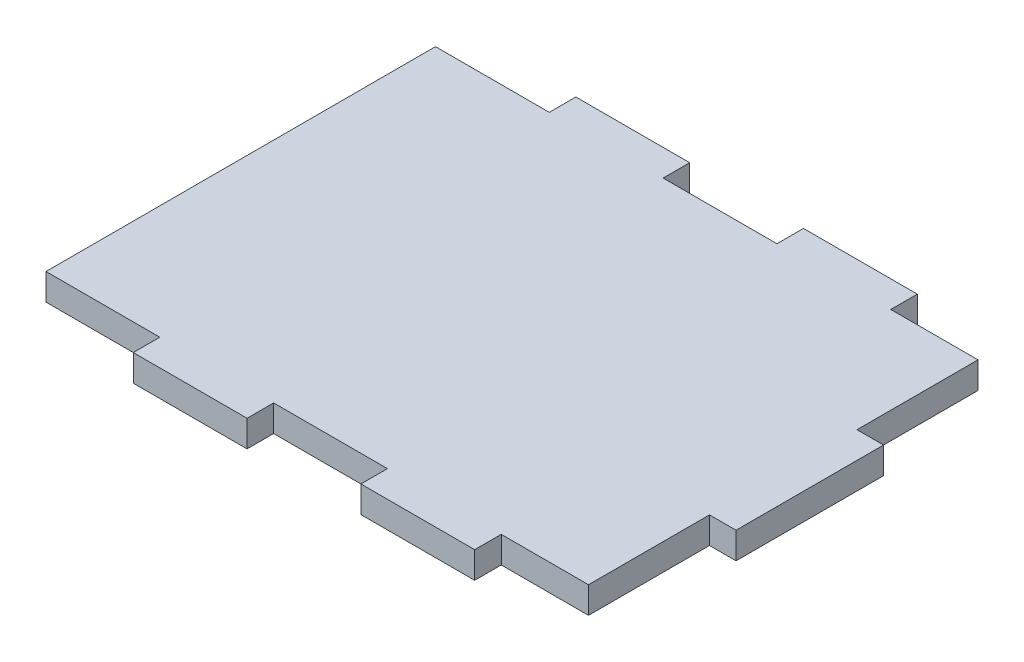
ISO-10303-21;
HEADER;
FILE_DESCRIPTION(('STEP AP214'),'2;1');
FILE_NAME('part.step','',(''),(''),'','','');
FILE_SCHEMA(('AUTOMOTIVE_DESIGN { 1 0 10303 214 1 1 1 1 }'));
ENDSEC;
DATA;
#1=APPLICATION_CONTEXT('core data for automotive mechanical design processes');
#2=APPLICATION_PROTOCOL_DEFINITION('international standard','automotive_design',2000,#1);
#3=PRODUCT_CONTEXT('',#1,'mechanical');
#4=PRODUCT('Part','Part','',(#3));
#5=PRODUCT_RELATED_PRODUCT_CATEGORY('part','',(#4));
#6=PRODUCT_DEFINITION_FORMATION('','',#4);
#7=PRODUCT_DEFINITION_CONTEXT('part definition',#1,'design');
#8=PRODUCT_DEFINITION('design','',#6,#7);
#9=PRODUCT_DEFINITION_SHAPE('','',#8);
#10=(LENGTH_UNIT() NAMED_UNIT(*) SI_UNIT(.MILLI.,.METRE.));
#11=(NAMED_UNIT(*) PLANE_ANGLE_UNIT() SI_UNIT($,.RADIAN.));
#12=(NAMED_UNIT(*) SI_UNIT($,.STERADIAN.) SOLID_ANGLE_UNIT());
#13=UNCERTAINTY_MEASURE_WITH_UNIT(LENGTH_MEASURE(1.E-05),#10,'distance_accuracy_value','');
#14=(GEOMETRIC_REPRESENTATION_CONTEXT(3) GLOBAL_UNCERTAINTY_ASSIGNED_CONTEXT((#13)) GLOBAL_UNIT_ASSIGNED_CONTEXT((#10,
#11,#12)) REPRESENTATION_CONTEXT('',''));
#15=CARTESIAN_POINT('',(0.,0.,0.));
#16=DIRECTION('',(0.,0.,1.));
#17=DIRECTION('',(1.,0.,0.));
#18=AXIS2_PLACEMENT_3D('',#15,#16,#17);
#19=CARTESIAN_POINT('',(57.15,5.334,44.45));
#20=DIRECTION('',(-1.,0.,0.));
#21=DIRECTION('',(0.,0.,1.));
#22=AXIS2_PLACEMENT_3D('',#19,#20,#21);
#23=PLANE('',#22);
#24=DIRECTION('',(0.,-1.,0.));
#25=VECTOR('',#24,1.);
#26=CARTESIAN_POINT('',(57.15,0.,14.8166666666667));
#27=LINE('',#26,#25);
#28=CARTESIAN_POINT('',(57.15,5.33400000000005,14.8166666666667));
#29=VERTEX_POINT('',#28);
#30=CARTESIAN_POINT('',(57.15,0.,14.8166666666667));
#31=VERTEX_POINT('',#30);
#32=EDGE_CURVE('E327',#29,#31,#27,.T.);
#33=ORIENTED_EDGE('',*,*,#32,.T.);
#34=DIRECTION('',(0.,0.,-1.));
#35=VECTOR('',#34,1.);
#36=CARTESIAN_POINT('',(57.15,0.,44.45));
#37=LINE('',#36,#35);
#38=CARTESIAN_POINT('',(57.15,0.,-14.8166666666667));
#39=VERTEX_POINT('',#38);
#40=EDGE_CURVE('E240',#31,#39,#37,.T.);
#41=ORIENTED_EDGE('',*,*,#40,.T.);
#42=DIRECTION('',(0.,1.,0.));
#43=VECTOR('',#42,1.);
#44=CARTESIAN_POINT('',(57.15,0.,-14.8166666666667));
#45=LINE('',#44,#43);
#46=CARTESIAN_POINT('',(57.15,5.33400000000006,-14.8166666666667));
#47=VERTEX_POINT('',#46);
#48=EDGE_CURVE('E323',#39,#47,#45,.T.);
#49=ORIENTED_EDGE('',*,*,#48,.T.);
#50=DIRECTION('',(0.,0.,-1.));
#51=VECTOR('',#50,1.);
#52=CARTESIAN_POINT('',(57.15,5.334,44.45));
#53=LINE('',#52,#51);
#54=EDGE_CURVE('E220',#29,#47,#53,.T.);
#55=ORIENTED_EDGE('',*,*,#54,.F.);
#56=EDGE_LOOP('',(#33,#41,#49,#55));
#57=FACE_BOUND('',#56,.T.);
#58=ADVANCED_FACE('F33',(#57),#23,.F.);
#59=CARTESIAN_POINT('',(-57.15,5.334,-44.45));
#60=DIRECTION('',(0.,0.,1.));
#61=DIRECTION('',(1.,0.,0.));
#62=AXIS2_PLACEMENT_3D('',#59,#60,#61);
#63=PLANE('',#62);
#64=DIRECTION('',(0.,-1.,0.));
#65=VECTOR('',#64,1.);
#66=CARTESIAN_POINT('',(-34.29,0.,-44.45));
#67=LINE('',#66,#65);
#68=CARTESIAN_POINT('',(-34.29,5.33400000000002,-44.45));
#69=VERTEX_POINT('',#68);
#70=CARTESIAN_POINT('',(-34.29,0.,-44.45));
#71=VERTEX_POINT('',#70);
#72=EDGE_CURVE('E57',#69,#71,#67,.T.);
#73=ORIENTED_EDGE('',*,*,#72,.F.);
#74=DIRECTION('',(-1.,0.,0.));
#75=VECTOR('',#74,1.);
#76=CARTESIAN_POINT('',(-57.15,5.334,-44.45));
#77=LINE('',#76,#75);
#78=CARTESIAN_POINT('',(-11.43,5.334,-44.45));
#79=VERTEX_POINT('',#78);
#80=EDGE_CURVE('E222',#79,#69,#77,.T.);
#81=ORIENTED_EDGE('',*,*,#80,.F.);
#82=DIRECTION('',(0.,1.,0.));
#83=VECTOR('',#82,1.);
#84=CARTESIAN_POINT('',(-11.43,0.,-44.45));
#85=LINE('',#84,#83);
#86=CARTESIAN_POINT('',(-11.43,0.,-44.45));
#87=VERTEX_POINT('',#86);
#88=EDGE_CURVE('E274',#87,#79,#85,.T.);
#89=ORIENTED_EDGE('',*,*,#88,.F.);
#90=DIRECTION('',(-1.,0.,0.));
#91=VECTOR('',#90,1.);
#92=CARTESIAN_POINT('',(-57.15,0.,-44.45));
#93=LINE('',#92,#91);
#94=EDGE_CURVE('E236',#87,#71,#93,.T.);
#95=ORIENTED_EDGE('',*,*,#94,.T.);
#96=EDGE_LOOP('',(#73,#81,#89,#95));
#97=FACE_BOUND('',#96,.T.);
#98=ADVANCED_FACE('F454',(#97),#63,.F.);
#99=DIRECTION('',(0.,-1.,0.));
#100=VECTOR('',#99,1.);
#101=CARTESIAN_POINT('',(11.43,0.,-44.45));
#102=LINE('',#101,#100);
#103=CARTESIAN_POINT('',(11.43,5.33400000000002,-44.45));
#104=VERTEX_POINT('',#103);
#105=CARTESIAN_POINT('',(11.43,0.,-44.45));
#106=VERTEX_POINT('',#105);
#107=EDGE_CURVE('E303',#104,#106,#102,.T.);
#108=ORIENTED_EDGE('',*,*,#107,.F.);
#109=CARTESIAN_POINT('',(34.29,5.33400000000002,-44.45));
#110=VERTEX_POINT('',#109);
#111=EDGE_CURVE('E248',#110,#104,#77,.T.);
#112=ORIENTED_EDGE('',*,*,#111,.F.);
#113=DIRECTION('',(0.,1.,0.));
#114=VECTOR('',#113,1.);
#115=CARTESIAN_POINT('',(34.29,0.,-44.45));
#116=LINE('',#115,#114);
#117=CARTESIAN_POINT('',(34.29,0.,-44.45));
#118=VERTEX_POINT('',#117);
#119=EDGE_CURVE('E293',#118,#110,#116,.T.);
#120=ORIENTED_EDGE('',*,*,#119,.F.);
#121=EDGE_CURVE('E231',#118,#106,#93,.T.);
#122=ORIENTED_EDGE('',*,*,#121,.T.);
#123=EDGE_LOOP('',(#108,#112,#120,#122));
#124=FACE_BOUND('',#123,.T.);
#125=ADVANCED_FACE('F399',(#124),#63,.F.);
#126=CARTESIAN_POINT('',(-57.15,5.334,44.45));
#127=DIRECTION('',(1.,0.,0.));
#128=DIRECTION('',(0.,0.,-1.));
#129=AXIS2_PLACEMENT_3D('',#126,#127,#128);
#130=PLANE('',#129);
#131=DIRECTION('',(0.,-1.,0.));
#132=VECTOR('',#131,1.);
#133=CARTESIAN_POINT('',(-57.15,0.,-39.116));
#134=LINE('',#133,#132);
#135=CARTESIAN_POINT('',(-57.15,5.334,-39.116));
#136=VERTEX_POINT('',#135);
#137=CARTESIAN_POINT('',(-57.15,0.,-39.116));
#138=VERTEX_POINT('',#137);
#139=EDGE_CURVE('E266',#136,#138,#134,.T.);
#140=ORIENTED_EDGE('',*,*,#139,.T.);
#141=DIRECTION('',(0.,0.,1.));
#142=VECTOR('',#141,1.);
#143=CARTESIAN_POINT('',(-57.15,0.,44.45));
#144=LINE('',#143,#142);
#145=CARTESIAN_POINT('',(-57.15,0.,39.116));
#146=VERTEX_POINT('',#145);
#147=EDGE_CURVE('E225',#138,#146,#144,.T.);
#148=ORIENTED_EDGE('',*,*,#147,.T.);
#149=DIRECTION('',(0.,1.,0.));
#150=VECTOR('',#149,1.);
#151=CARTESIAN_POINT('',(-57.15,0.,39.116));
#152=LINE('',#151,#150);
#153=CARTESIAN_POINT('',(-57.15,5.334,39.116));
#154=VERTEX_POINT('',#153);
#155=EDGE_CURVE('E339',#146,#154,#152,.T.);
#156=ORIENTED_EDGE('',*,*,#155,.T.);
#157=DIRECTION('',(0.,0.,1.));
#158=VECTOR('',#157,1.);
#159=CARTESIAN_POINT('',(-57.15,5.334,44.45));
#160=LINE('',#159,#158);
#161=EDGE_CURVE('E245',#136,#154,#160,.T.);
#162=ORIENTED_EDGE('',*,*,#161,.F.);
#163=EDGE_LOOP('',(#140,#148,#156,#162));
#164=FACE_BOUND('',#163,.T.);
#165=ADVANCED_FACE('F378',(#164),#130,.F.);
#166=CARTESIAN_POINT('',(-57.15,5.334,44.45));
#167=DIRECTION('',(0.,0.,-1.));
#168=DIRECTION('',(-1.,0.,0.));
#169=AXIS2_PLACEMENT_3D('',#166,#167,#168);
#170=PLANE('',#169);
#171=DIRECTION('',(0.,-1.,0.));
#172=VECTOR('',#171,1.);
#173=CARTESIAN_POINT('',(34.29,0.,44.45));
#174=LINE('',#173,#172);
#175=CARTESIAN_POINT('',(34.29,5.33400000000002,44.45));
#176=VERTEX_POINT('',#175);
#177=CARTESIAN_POINT('',(34.29,0.,44.45));
#178=VERTEX_POINT('',#177);
#179=EDGE_CURVE('E356',#176,#178,#174,.T.);
#180=ORIENTED_EDGE('',*,*,#179,.F.);
#181=DIRECTION('',(1.,0.,0.));
#182=VECTOR('',#181,1.);
#183=CARTESIAN_POINT('',(-57.15,5.334,44.45));
#184=LINE('',#183,#182);
#185=CARTESIAN_POINT('',(11.43,5.334,44.45));
#186=VERTEX_POINT('',#185);
#187=EDGE_CURVE('E41',#186,#176,#184,.T.);
#188=ORIENTED_EDGE('',*,*,#187,.F.);
#189=DIRECTION('',(0.,1.,0.));
#190=VECTOR('',#189,1.);
#191=CARTESIAN_POINT('',(11.43,0.,44.45));
#192=LINE('',#191,#190);
#193=CARTESIAN_POINT('',(11.43,0.,44.45));
#194=VERTEX_POINT('',#193);
#195=EDGE_CURVE('E346',#194,#186,#192,.T.);
#196=ORIENTED_EDGE('',*,*,#195,.F.);
#197=DIRECTION('',(1.,0.,0.));
#198=VECTOR('',#197,1.);
#199=CARTESIAN_POINT('',(-57.15,0.,44.45));
#200=LINE('',#199,#198);
#201=EDGE_CURVE('E36',#194,#178,#200,.T.);
#202=ORIENTED_EDGE('',*,*,#201,.T.);
#203=EDGE_LOOP('',(#180,#188,#196,#202));
#204=FACE_BOUND('',#203,.T.);
#205=ADVANCED_FACE('F437',(#204),#170,.F.);
#206=DIRECTION('',(0.,-1.,0.));
#207=VECTOR('',#206,1.);
#208=CARTESIAN_POINT('',(-11.43,0.,44.45));
#209=LINE('',#208,#207);
#210=CARTESIAN_POINT('',(-11.43,5.33400000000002,44.45));
#211=VERTEX_POINT('',#210);
#212=CARTESIAN_POINT('',(-11.43,0.,44.45));
#213=VERTEX_POINT('',#212);
#214=EDGE_CURVE('E213',#211,#213,#209,.T.);
#215=ORIENTED_EDGE('',*,*,#214,.F.);
#216=CARTESIAN_POINT('',(-34.29,5.33400000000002,44.45));
#217=VERTEX_POINT('',#216);
#218=EDGE_CURVE('E11',#217,#211,#184,.T.);
#219=ORIENTED_EDGE('',*,*,#218,.F.);
#220=DIRECTION('',(0.,1.,0.));
#221=VECTOR('',#220,1.);
#222=CARTESIAN_POINT('',(-34.29,0.,44.45));
#223=LINE('',#222,#221);
#224=CARTESIAN_POINT('',(-34.29,0.,44.45));
#225=VERTEX_POINT('',#224);
#226=EDGE_CURVE('E199',#225,#217,#223,.T.);
#227=ORIENTED_EDGE('',*,*,#226,.F.);
#228=EDGE_CURVE('E212',#225,#213,#200,.T.);
#229=ORIENTED_EDGE('',*,*,#228,.T.);
#230=EDGE_LOOP('',(#215,#219,#227,#229));
#231=FACE_BOUND('',#230,.T.);
#232=ADVANCED_FACE('F211',(#231),#170,.F.);
#233=CARTESIAN_POINT('',(57.15,5.334,-44.45));
#234=DIRECTION('',(0.,-1.,0.));
#235=DIRECTION('',(0.,0.,-1.));
#236=AXIS2_PLACEMENT_3D('',#233,#234,#235);
#237=PLANE('',#236);
#238=DIRECTION('',(0.,0.,-1.));
#239=VECTOR('',#238,1.);
#240=CARTESIAN_POINT('',(-11.43,5.33400000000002,44.45));
#241=LINE('',#240,#239);
#242=CARTESIAN_POINT('',(-11.43,5.33400000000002,39.116));
#243=VERTEX_POINT('',#242);
#244=EDGE_CURVE('E359',#211,#243,#241,.T.);
#245=ORIENTED_EDGE('',*,*,#244,.T.);
#246=DIRECTION('',(-1.,0.,0.));
#247=VECTOR('',#246,1.);
#248=CARTESIAN_POINT('',(57.15,5.334,39.116));
#249=LINE('',#248,#247);
#250=CARTESIAN_POINT('',(11.43,5.33400000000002,39.116));
#251=VERTEX_POINT('',#250);
#252=EDGE_CURVE('E260',#251,#243,#249,.T.);
#253=ORIENTED_EDGE('',*,*,#252,.F.);
#254=DIRECTION('',(0.,0.,-1.));
#255=VECTOR('',#254,1.);
#256=CARTESIAN_POINT('',(11.43,5.33400000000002,44.45));
#257=LINE('',#256,#255);
#258=EDGE_CURVE('E349',#186,#251,#257,.T.);
#259=ORIENTED_EDGE('',*,*,#258,.F.);
#260=ORIENTED_EDGE('',*,*,#187,.T.);
#261=DIRECTION('',(0.,0.,-1.));
#262=VECTOR('',#261,1.);
#263=CARTESIAN_POINT('',(34.29,5.33400000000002,44.45));
#264=LINE('',#263,#262);
#265=CARTESIAN_POINT('',(34.29,5.33400000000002,39.116));
#266=VERTEX_POINT('',#265);
#267=EDGE_CURVE('E341',#176,#266,#264,.T.);
#268=ORIENTED_EDGE('',*,*,#267,.T.);
#269=CARTESIAN_POINT('',(51.816,5.334,39.116));
#270=VERTEX_POINT('',#269);
#271=EDGE_CURVE('E257',#270,#266,#249,.T.);
#272=ORIENTED_EDGE('',*,*,#271,.F.);
#273=DIRECTION('',(0.,0.,1.));
#274=VECTOR('',#273,1.);
#275=CARTESIAN_POINT('',(51.816,5.334,-44.45));
#276=LINE('',#275,#274);
#277=CARTESIAN_POINT('',(51.816,5.33400000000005,14.8166666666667));
#278=VERTEX_POINT('',#277);
#279=EDGE_CURVE('E255',#278,#270,#276,.T.);
#280=ORIENTED_EDGE('',*,*,#279,.F.);
#281=DIRECTION('',(1.,0.,0.));
#282=VECTOR('',#281,1.);
#283=CARTESIAN_POINT('',(51.816,5.33400000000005,14.8166666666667));
#284=LINE('',#283,#282);
#285=EDGE_CURVE('E320',#278,#29,#284,.T.);
#286=ORIENTED_EDGE('',*,*,#285,.T.);
#287=ORIENTED_EDGE('',*,*,#54,.T.);
#288=DIRECTION('',(1.,0.,0.));
#289=VECTOR('',#288,1.);
#290=CARTESIAN_POINT('',(51.816,5.33400000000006,-14.8166666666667));
#291=LINE('',#290,#289);
#292=CARTESIAN_POINT('',(51.816,5.33400000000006,-14.8166666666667));
#293=VERTEX_POINT('',#292);
#294=EDGE_CURVE('E318',#293,#47,#291,.T.);
#295=ORIENTED_EDGE('',*,*,#294,.F.);
#296=CARTESIAN_POINT('',(51.816,5.334,-39.116));
#297=VERTEX_POINT('',#296);
#298=EDGE_CURVE('E254',#297,#293,#276,.T.);
#299=ORIENTED_EDGE('',*,*,#298,.F.);
#300=DIRECTION('',(1.,0.,0.));
#301=VECTOR('',#300,1.);
#302=CARTESIAN_POINT('',(57.15,5.334,-39.116));
#303=LINE('',#302,#301);
#304=CARTESIAN_POINT('',(34.29,5.33400000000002,-39.116));
#305=VERTEX_POINT('',#304);
#306=EDGE_CURVE('E251',#305,#297,#303,.T.);
#307=ORIENTED_EDGE('',*,*,#306,.F.);
#308=DIRECTION('',(0.,0.,1.));
#309=VECTOR('',#308,1.);
#310=CARTESIAN_POINT('',(34.29,5.33400000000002,-44.45));
#311=LINE('',#310,#309);
#312=EDGE_CURVE('E296',#110,#305,#311,.T.);
#313=ORIENTED_EDGE('',*,*,#312,.F.);
#314=ORIENTED_EDGE('',*,*,#111,.T.);
#315=DIRECTION('',(0.,0.,1.));
#316=VECTOR('',#315,1.);
#317=CARTESIAN_POINT('',(11.43,5.33400000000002,-44.45));
#318=LINE('',#317,#316);
#319=CARTESIAN_POINT('',(11.43,5.33400000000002,-39.116));
#320=VERTEX_POINT('',#319);
#321=EDGE_CURVE('E286',#104,#320,#318,.T.);
#322=ORIENTED_EDGE('',*,*,#321,.T.);
#323=CARTESIAN_POINT('',(-11.43,5.33400000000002,-39.116));
#324=VERTEX_POINT('',#323);
#325=EDGE_CURVE('E253',#324,#320,#303,.T.);
#326=ORIENTED_EDGE('',*,*,#325,.F.);
#327=DIRECTION('',(0.,0.,1.));
#328=VECTOR('',#327,1.);
#329=CARTESIAN_POINT('',(-11.43,5.33400000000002,-44.45));
#330=LINE('',#329,#328);
#331=EDGE_CURVE('E277',#79,#324,#330,.T.);
#332=ORIENTED_EDGE('',*,*,#331,.F.);
#333=ORIENTED_EDGE('',*,*,#80,.T.);
#334=DIRECTION('',(0.,0.,1.));
#335=VECTOR('',#334,1.);
#336=CARTESIAN_POINT('',(-34.29,5.33400000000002,-44.45));
#337=LINE('',#336,#335);
#338=CARTESIAN_POINT('',(-34.29,5.33400000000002,-39.116));
#339=VERTEX_POINT('',#338);
#340=EDGE_CURVE('E270',#69,#339,#337,.T.);
#341=ORIENTED_EDGE('',*,*,#340,.T.);
#342=EDGE_CURVE('E242',#136,#339,#303,.T.);
#343=ORIENTED_EDGE('',*,*,#342,.F.);
#344=ORIENTED_EDGE('',*,*,#161,.T.);
#345=CARTESIAN_POINT('',(-34.29,5.33400000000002,39.116));
#346=VERTEX_POINT('',#345);
#347=EDGE_CURVE('E258',#346,#154,#249,.T.);
#348=ORIENTED_EDGE('',*,*,#347,.F.);
#349=DIRECTION('',(0.,0.,-1.));
#350=VECTOR('',#349,1.);
#351=CARTESIAN_POINT('',(-34.29,5.33400000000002,44.45));
#352=LINE('',#351,#350);
#353=EDGE_CURVE('E204',#217,#346,#352,.T.);
#354=ORIENTED_EDGE('',*,*,#353,.F.);
#355=ORIENTED_EDGE('',*,*,#218,.T.);
#356=EDGE_LOOP('',(#245,#253,#259,#260,#268,#272,#280,#286,#287,#295,#299,#307,#313,#314,#322,
#326,#332,#333,#341,#343,#344,#348,#354,#355));
#357=FACE_BOUND('',#356,.T.);
#358=ADVANCED_FACE('F373',(#357),#237,.F.);
#359=CARTESIAN_POINT('',(57.15,0.,-44.45));
#360=DIRECTION('',(0.,-1.,0.));
#361=DIRECTION('',(0.,0.,-1.));
#362=AXIS2_PLACEMENT_3D('',#359,#360,#361);
#363=PLANE('',#362);
#364=ORIENTED_EDGE('',*,*,#147,.F.);
#365=DIRECTION('',(1.,0.,0.));
#366=VECTOR('',#365,1.);
#367=CARTESIAN_POINT('',(-57.15,0.,-39.116));
#368=LINE('',#367,#366);
#369=CARTESIAN_POINT('',(-34.29,0.,-39.116));
#370=VERTEX_POINT('',#369);
#371=EDGE_CURVE('E261',#138,#370,#368,.T.);
#372=ORIENTED_EDGE('',*,*,#371,.T.);
#373=DIRECTION('',(0.,0.,1.));
#374=VECTOR('',#373,1.);
#375=CARTESIAN_POINT('',(-34.29,0.,-44.45));
#376=LINE('',#375,#374);
#377=EDGE_CURVE('E271',#71,#370,#376,.T.);
#378=ORIENTED_EDGE('',*,*,#377,.F.);
#379=ORIENTED_EDGE('',*,*,#94,.F.);
#380=DIRECTION('',(0.,0.,1.));
#381=VECTOR('',#380,1.);
#382=CARTESIAN_POINT('',(-11.43,0.,-44.45));
#383=LINE('',#382,#381);
#384=CARTESIAN_POINT('',(-11.43,0.,-39.116));
#385=VERTEX_POINT('',#384);
#386=EDGE_CURVE('E273',#87,#385,#383,.T.);
#387=ORIENTED_EDGE('',*,*,#386,.T.);
#388=CARTESIAN_POINT('',(11.43,0.,-39.116));
#389=VERTEX_POINT('',#388);
#390=EDGE_CURVE('E264',#385,#389,#368,.T.);
#391=ORIENTED_EDGE('',*,*,#390,.T.);
#392=DIRECTION('',(0.,0.,1.));
#393=VECTOR('',#392,1.);
#394=CARTESIAN_POINT('',(11.43,0.,-44.45));
#395=LINE('',#394,#393);
#396=EDGE_CURVE('E289',#106,#389,#395,.T.);
#397=ORIENTED_EDGE('',*,*,#396,.F.);
#398=ORIENTED_EDGE('',*,*,#121,.F.);
#399=DIRECTION('',(0.,0.,1.));
#400=VECTOR('',#399,1.);
#401=CARTESIAN_POINT('',(34.29,0.,-44.45));
#402=LINE('',#401,#400);
#403=CARTESIAN_POINT('',(34.29,0.,-39.116));
#404=VERTEX_POINT('',#403);
#405=EDGE_CURVE('E292',#118,#404,#402,.T.);
#406=ORIENTED_EDGE('',*,*,#405,.T.);
#407=CARTESIAN_POINT('',(51.816,0.,-39.116));
#408=VERTEX_POINT('',#407);
#409=EDGE_CURVE('E265',#404,#408,#368,.T.);
#410=ORIENTED_EDGE('',*,*,#409,.T.);
#411=DIRECTION('',(0.,0.,1.));
#412=VECTOR('',#411,1.);
#413=CARTESIAN_POINT('',(51.816,0.,-44.45));
#414=LINE('',#413,#412);
#415=CARTESIAN_POINT('',(51.816,0.,-14.8166666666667));
#416=VERTEX_POINT('',#415);
#417=EDGE_CURVE('E306',#408,#416,#414,.T.);
#418=ORIENTED_EDGE('',*,*,#417,.T.);
#419=DIRECTION('',(1.,0.,0.));
#420=VECTOR('',#419,1.);
#421=CARTESIAN_POINT('',(51.816,0.,-14.8166666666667));
#422=LINE('',#421,#420);
#423=EDGE_CURVE('E314',#416,#39,#422,.T.);
#424=ORIENTED_EDGE('',*,*,#423,.T.);
#425=ORIENTED_EDGE('',*,*,#40,.F.);
#426=DIRECTION('',(1.,0.,0.));
#427=VECTOR('',#426,1.);
#428=CARTESIAN_POINT('',(51.816,0.,14.8166666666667));
#429=LINE('',#428,#427);
#430=CARTESIAN_POINT('',(51.816,0.,14.8166666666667));
#431=VERTEX_POINT('',#430);
#432=EDGE_CURVE('E312',#431,#31,#429,.T.);
#433=ORIENTED_EDGE('',*,*,#432,.F.);
#434=CARTESIAN_POINT('',(51.816,0.,39.116));
#435=VERTEX_POINT('',#434);
#436=EDGE_CURVE('E311',#431,#435,#414,.T.);
#437=ORIENTED_EDGE('',*,*,#436,.T.);
#438=DIRECTION('',(-1.,0.,0.));
#439=VECTOR('',#438,1.);
#440=CARTESIAN_POINT('',(57.15,0.,39.116));
#441=LINE('',#440,#439);
#442=CARTESIAN_POINT('',(34.29,0.,39.116));
#443=VERTEX_POINT('',#442);
#444=EDGE_CURVE('E335',#435,#443,#441,.T.);
#445=ORIENTED_EDGE('',*,*,#444,.T.);
#446=DIRECTION('',(0.,0.,-1.));
#447=VECTOR('',#446,1.);
#448=CARTESIAN_POINT('',(34.29,0.,44.45));
#449=LINE('',#448,#447);
#450=EDGE_CURVE('E342',#178,#443,#449,.T.);
#451=ORIENTED_EDGE('',*,*,#450,.F.);
#452=ORIENTED_EDGE('',*,*,#201,.F.);
#453=DIRECTION('',(0.,0.,-1.));
#454=VECTOR('',#453,1.);
#455=CARTESIAN_POINT('',(11.43,0.,44.45));
#456=LINE('',#455,#454);
#457=CARTESIAN_POINT('',(11.43,0.,39.116));
#458=VERTEX_POINT('',#457);
#459=EDGE_CURVE('E345',#194,#458,#456,.T.);
#460=ORIENTED_EDGE('',*,*,#459,.T.);
#461=CARTESIAN_POINT('',(-11.43,0.,39.116));
#462=VERTEX_POINT('',#461);
#463=EDGE_CURVE('E338',#458,#462,#441,.T.);
#464=ORIENTED_EDGE('',*,*,#463,.T.);
#465=DIRECTION('',(0.,0.,-1.));
#466=VECTOR('',#465,1.);
#467=CARTESIAN_POINT('',(-11.43,0.,44.45));
#468=LINE('',#467,#466);
#469=EDGE_CURVE('E205',#213,#462,#468,.T.);
#470=ORIENTED_EDGE('',*,*,#469,.F.);
#471=ORIENTED_EDGE('',*,*,#228,.F.);
#472=DIRECTION('',(0.,0.,-1.));
#473=VECTOR('',#472,1.);
#474=CARTESIAN_POINT('',(-34.29,0.,44.45));
#475=LINE('',#474,#473);
#476=CARTESIAN_POINT('',(-34.2899999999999,0.,39.116));
#477=VERTEX_POINT('',#476);
#478=EDGE_CURVE('E196',#225,#477,#475,.T.);
#479=ORIENTED_EDGE('',*,*,#478,.T.);
#480=EDGE_CURVE('E49',#477,#146,#441,.T.);
#481=ORIENTED_EDGE('',*,*,#480,.T.);
#482=EDGE_LOOP('',(#364,#372,#378,#379,#387,#391,#397,#398,#406,#410,#418,#424,#425,#433,#437,
#445,#451,#452,#460,#464,#470,#471,#479,#481));
#483=FACE_BOUND('',#482,.T.);
#484=ADVANCED_FACE('F217',(#483),#363,.T.);
#485=CARTESIAN_POINT('',(-34.29,0.,44.45));
#486=DIRECTION('',(-1.,0.,0.));
#487=DIRECTION('',(0.,0.,1.));
#488=AXIS2_PLACEMENT_3D('',#485,#486,#487);
#489=PLANE('',#488);
#490=DIRECTION('',(0.,1.,0.));
#491=VECTOR('',#490,1.);
#492=CARTESIAN_POINT('',(-34.29,0.,39.116));
#493=LINE('',#492,#491);
#494=EDGE_CURVE('E201',#477,#346,#493,.T.);
#495=ORIENTED_EDGE('',*,*,#494,.F.);
#496=ORIENTED_EDGE('',*,*,#478,.F.);
#497=ORIENTED_EDGE('',*,*,#226,.T.);
#498=ORIENTED_EDGE('',*,*,#353,.T.);
#499=EDGE_LOOP('',(#495,#496,#497,#498));
#500=FACE_BOUND('',#499,.T.);
#501=ADVANCED_FACE('F198',(#500),#489,.T.);
#502=CARTESIAN_POINT('',(-57.15,203.2,39.116));
#503=DIRECTION('',(0.,0.,1.));
#504=DIRECTION('',(1.,0.,0.));
#505=AXIS2_PLACEMENT_3D('',#502,#503,#504);
#506=PLANE('',#505);
#507=ORIENTED_EDGE('',*,*,#347,.T.);
#508=ORIENTED_EDGE('',*,*,#155,.F.);
#509=ORIENTED_EDGE('',*,*,#480,.F.);
#510=ORIENTED_EDGE('',*,*,#494,.T.);
#511=EDGE_LOOP('',(#507,#508,#509,#510));
#512=FACE_BOUND('',#511,.T.);
#513=ADVANCED_FACE('F376',(#512),#506,.T.);
#514=CARTESIAN_POINT('',(-11.43,0.,44.45));
#515=DIRECTION('',(1.,0.,0.));
#516=DIRECTION('',(0.,-1.,0.));
#517=AXIS2_PLACEMENT_3D('',#514,#515,#516);
#518=PLANE('',#517);
#519=DIRECTION('',(0.,-1.,0.));
#520=VECTOR('',#519,1.);
#521=CARTESIAN_POINT('',(-11.43,0.,39.116));
#522=LINE('',#521,#520);
#523=EDGE_CURVE('E367',#243,#462,#522,.T.);
#524=ORIENTED_EDGE('',*,*,#523,.F.);
#525=ORIENTED_EDGE('',*,*,#244,.F.);
#526=ORIENTED_EDGE('',*,*,#214,.T.);
#527=ORIENTED_EDGE('',*,*,#469,.T.);
#528=EDGE_LOOP('',(#524,#525,#526,#527));
#529=FACE_BOUND('',#528,.T.);
#530=ADVANCED_FACE('F371',(#529),#518,.T.);
#531=CARTESIAN_POINT('',(11.43,0.,44.45));
#532=DIRECTION('',(-1.,0.,0.));
#533=DIRECTION('',(0.,1.,0.));
#534=AXIS2_PLACEMENT_3D('',#531,#532,#533);
#535=PLANE('',#534);
#536=DIRECTION('',(0.,1.,0.));
#537=VECTOR('',#536,1.);
#538=CARTESIAN_POINT('',(11.43,0.,39.116));
#539=LINE('',#538,#537);
#540=EDGE_CURVE('E353',#458,#251,#539,.T.);
#541=ORIENTED_EDGE('',*,*,#540,.F.);
#542=ORIENTED_EDGE('',*,*,#459,.F.);
#543=ORIENTED_EDGE('',*,*,#195,.T.);
#544=ORIENTED_EDGE('',*,*,#258,.T.);
#545=EDGE_LOOP('',(#541,#542,#543,#544));
#546=FACE_BOUND('',#545,.T.);
#547=ADVANCED_FACE('F440',(#546),#535,.T.);
#548=ORIENTED_EDGE('',*,*,#252,.T.);
#549=ORIENTED_EDGE('',*,*,#523,.T.);
#550=ORIENTED_EDGE('',*,*,#463,.F.);
#551=ORIENTED_EDGE('',*,*,#540,.T.);
#552=EDGE_LOOP('',(#548,#549,#550,#551));
#553=FACE_BOUND('',#552,.T.);
#554=ADVANCED_FACE('F443',(#553),#506,.T.);
#555=CARTESIAN_POINT('',(34.29,0.,44.45));
#556=DIRECTION('',(1.,0.,0.));
#557=DIRECTION('',(0.,-1.,0.));
#558=AXIS2_PLACEMENT_3D('',#555,#556,#557);
#559=PLANE('',#558);
#560=DIRECTION('',(0.,-1.,0.));
#561=VECTOR('',#560,1.);
#562=CARTESIAN_POINT('',(34.29,0.,39.116));
#563=LINE('',#562,#561);
#564=EDGE_CURVE('E357',#266,#443,#563,.T.);
#565=ORIENTED_EDGE('',*,*,#564,.F.);
#566=ORIENTED_EDGE('',*,*,#267,.F.);
#567=ORIENTED_EDGE('',*,*,#179,.T.);
#568=ORIENTED_EDGE('',*,*,#450,.T.);
#569=EDGE_LOOP('',(#565,#566,#567,#568));
#570=FACE_BOUND('',#569,.T.);
#571=ADVANCED_FACE('F435',(#570),#559,.T.);
#572=ORIENTED_EDGE('',*,*,#271,.T.);
#573=ORIENTED_EDGE('',*,*,#564,.T.);
#574=ORIENTED_EDGE('',*,*,#444,.F.);
#575=DIRECTION('',(0.,-1.,0.));
#576=VECTOR('',#575,1.);
#577=CARTESIAN_POINT('',(51.816,203.2,39.116));
#578=LINE('',#577,#576);
#579=EDGE_CURVE('E330',#270,#435,#578,.T.);
#580=ORIENTED_EDGE('',*,*,#579,.F.);
#581=EDGE_LOOP('',(#572,#573,#574,#580));
#582=FACE_BOUND('',#581,.T.);
#583=ADVANCED_FACE('F430',(#582),#506,.T.);
#584=CARTESIAN_POINT('',(51.816,0.,14.8166666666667));
#585=DIRECTION('',(0.,0.,1.));
#586=DIRECTION('',(1.,0.,0.));
#587=AXIS2_PLACEMENT_3D('',#584,#585,#586);
#588=PLANE('',#587);
#589=ORIENTED_EDGE('',*,*,#32,.F.);
#590=ORIENTED_EDGE('',*,*,#285,.F.);
#591=DIRECTION('',(0.,-1.,0.));
#592=VECTOR('',#591,1.);
#593=CARTESIAN_POINT('',(51.816,0.,14.8166666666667));
#594=LINE('',#593,#592);
#595=EDGE_CURVE('E326',#278,#431,#594,.T.);
#596=ORIENTED_EDGE('',*,*,#595,.T.);
#597=ORIENTED_EDGE('',*,*,#432,.T.);
#598=EDGE_LOOP('',(#589,#590,#596,#597));
#599=FACE_BOUND('',#598,.T.);
#600=ADVANCED_FACE('F420',(#599),#588,.T.);
#601=CARTESIAN_POINT('',(51.816,203.2,44.45));
#602=DIRECTION('',(1.,0.,0.));
#603=DIRECTION('',(0.,0.,-1.));
#604=AXIS2_PLACEMENT_3D('',#601,#602,#603);
#605=PLANE('',#604);
#606=ORIENTED_EDGE('',*,*,#279,.T.);
#607=ORIENTED_EDGE('',*,*,#579,.T.);
#608=ORIENTED_EDGE('',*,*,#436,.F.);
#609=ORIENTED_EDGE('',*,*,#595,.F.);
#610=EDGE_LOOP('',(#606,#607,#608,#609));
#611=FACE_BOUND('',#610,.T.);
#612=ADVANCED_FACE('F426',(#611),#605,.T.);
#613=CARTESIAN_POINT('',(51.816,0.,-14.8166666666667));
#614=DIRECTION('',(0.,0.,-1.));
#615=DIRECTION('',(-1.,0.,0.));
#616=AXIS2_PLACEMENT_3D('',#613,#614,#615);
#617=PLANE('',#616);
#618=ORIENTED_EDGE('',*,*,#48,.F.);
#619=ORIENTED_EDGE('',*,*,#423,.F.);
#620=DIRECTION('',(0.,1.,0.));
#621=VECTOR('',#620,1.);
#622=CARTESIAN_POINT('',(51.816,0.,-14.8166666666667));
#623=LINE('',#622,#621);
#624=EDGE_CURVE('E315',#416,#293,#623,.T.);
#625=ORIENTED_EDGE('',*,*,#624,.T.);
#626=ORIENTED_EDGE('',*,*,#294,.T.);
#627=EDGE_LOOP('',(#618,#619,#625,#626));
#628=FACE_BOUND('',#627,.T.);
#629=ADVANCED_FACE('F414',(#628),#617,.T.);
#630=ORIENTED_EDGE('',*,*,#298,.T.);
#631=ORIENTED_EDGE('',*,*,#624,.F.);
#632=ORIENTED_EDGE('',*,*,#417,.F.);
#633=DIRECTION('',(0.,-1.,0.));
#634=VECTOR('',#633,1.);
#635=CARTESIAN_POINT('',(51.816,29.0285714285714,-39.116));
#636=LINE('',#635,#634);
#637=EDGE_CURVE('E268',#297,#408,#636,.T.);
#638=ORIENTED_EDGE('',*,*,#637,.F.);
#639=EDGE_LOOP('',(#630,#631,#632,#638));
#640=FACE_BOUND('',#639,.T.);
#641=ADVANCED_FACE('F410',(#640),#605,.T.);
#642=CARTESIAN_POINT('',(34.29,0.,-44.45));
#643=DIRECTION('',(1.,0.,0.));
#644=DIRECTION('',(0.,0.,-1.));
#645=AXIS2_PLACEMENT_3D('',#642,#643,#644);
#646=PLANE('',#645);
#647=DIRECTION('',(0.,1.,0.));
#648=VECTOR('',#647,1.);
#649=CARTESIAN_POINT('',(34.29,0.,-39.116));
#650=LINE('',#649,#648);
#651=EDGE_CURVE('E300',#404,#305,#650,.T.);
#652=ORIENTED_EDGE('',*,*,#651,.F.);
#653=ORIENTED_EDGE('',*,*,#405,.F.);
#654=ORIENTED_EDGE('',*,*,#119,.T.);
#655=ORIENTED_EDGE('',*,*,#312,.T.);
#656=EDGE_LOOP('',(#652,#653,#654,#655));
#657=FACE_BOUND('',#656,.T.);
#658=ADVANCED_FACE('F584',(#657),#646,.T.);
#659=CARTESIAN_POINT('',(57.15,203.2,-39.116));
#660=DIRECTION('',(0.,0.,-1.));
#661=DIRECTION('',(-1.,0.,0.));
#662=AXIS2_PLACEMENT_3D('',#659,#660,#661);
#663=PLANE('',#662);
#664=ORIENTED_EDGE('',*,*,#306,.T.);
#665=ORIENTED_EDGE('',*,*,#637,.T.);
#666=ORIENTED_EDGE('',*,*,#409,.F.);
#667=ORIENTED_EDGE('',*,*,#651,.T.);
#668=EDGE_LOOP('',(#664,#665,#666,#667));
#669=FACE_BOUND('',#668,.T.);
#670=ADVANCED_FACE('F406',(#669),#663,.T.);
#671=CARTESIAN_POINT('',(11.43,0.,-44.45));
#672=DIRECTION('',(-1.,0.,0.));
#673=DIRECTION('',(0.,-1.,0.));
#674=AXIS2_PLACEMENT_3D('',#671,#672,#673);
#675=PLANE('',#674);
#676=DIRECTION('',(0.,-1.,0.));
#677=VECTOR('',#676,1.);
#678=CARTESIAN_POINT('',(11.43,0.,-39.116));
#679=LINE('',#678,#677);
#680=EDGE_CURVE('E304',#320,#389,#679,.T.);
#681=ORIENTED_EDGE('',*,*,#680,.F.);
#682=ORIENTED_EDGE('',*,*,#321,.F.);
#683=ORIENTED_EDGE('',*,*,#107,.T.);
#684=ORIENTED_EDGE('',*,*,#396,.T.);
#685=EDGE_LOOP('',(#681,#682,#683,#684));
#686=FACE_BOUND('',#685,.T.);
#687=ADVANCED_FACE('F389',(#686),#675,.T.);
#688=CARTESIAN_POINT('',(-11.43,0.,-44.45));
#689=DIRECTION('',(1.,0.,0.));
#690=DIRECTION('',(0.,1.,0.));
#691=AXIS2_PLACEMENT_3D('',#688,#689,#690);
#692=PLANE('',#691);
#693=DIRECTION('',(0.,1.,0.));
#694=VECTOR('',#693,1.);
#695=CARTESIAN_POINT('',(-11.43,0.,-39.116));
#696=LINE('',#695,#694);
#697=EDGE_CURVE('E281',#385,#324,#696,.T.);
#698=ORIENTED_EDGE('',*,*,#697,.F.);
#699=ORIENTED_EDGE('',*,*,#386,.F.);
#700=ORIENTED_EDGE('',*,*,#88,.T.);
#701=ORIENTED_EDGE('',*,*,#331,.T.);
#702=EDGE_LOOP('',(#698,#699,#700,#701));
#703=FACE_BOUND('',#702,.T.);
#704=ADVANCED_FACE('F606',(#703),#692,.T.);
#705=ORIENTED_EDGE('',*,*,#325,.T.);
#706=ORIENTED_EDGE('',*,*,#680,.T.);
#707=ORIENTED_EDGE('',*,*,#390,.F.);
#708=ORIENTED_EDGE('',*,*,#697,.T.);
#709=EDGE_LOOP('',(#705,#706,#707,#708));
#710=FACE_BOUND('',#709,.T.);
#711=ADVANCED_FACE('F385',(#710),#663,.T.);
#712=ORIENTED_EDGE('',*,*,#342,.T.);
#713=DIRECTION('',(0.,-1.,0.));
#714=VECTOR('',#713,1.);
#715=CARTESIAN_POINT('',(-34.29,0.,-39.116));
#716=LINE('',#715,#714);
#717=EDGE_CURVE('E284',#339,#370,#716,.T.);
#718=ORIENTED_EDGE('',*,*,#717,.T.);
#719=ORIENTED_EDGE('',*,*,#371,.F.);
#720=ORIENTED_EDGE('',*,*,#139,.F.);
#721=EDGE_LOOP('',(#712,#718,#719,#720));
#722=FACE_BOUND('',#721,.T.);
#723=ADVANCED_FACE('F444',(#722),#663,.T.);
#724=CARTESIAN_POINT('',(-34.29,0.,-44.45));
#725=DIRECTION('',(-1.,0.,0.));
#726=DIRECTION('',(0.,-1.,0.));
#727=AXIS2_PLACEMENT_3D('',#724,#725,#726);
#728=PLANE('',#727);
#729=ORIENTED_EDGE('',*,*,#717,.F.);
#730=ORIENTED_EDGE('',*,*,#340,.F.);
#731=ORIENTED_EDGE('',*,*,#72,.T.);
#732=ORIENTED_EDGE('',*,*,#377,.T.);
#733=EDGE_LOOP('',(#729,#730,#731,#732));
#734=FACE_BOUND('',#733,.T.);
#735=ADVANCED_FACE('F445',(#734),#728,.T.);
#736=CLOSED_SHELL('',(#58,#98,#125,#165,#205,#232,#358,#484,#501,#513,#530,#547,#554,#571,#583,
#600,#612,#629,#641,#658,#670,#687,#704,#711,#723,#735));
#737=MANIFOLD_SOLID_BREP('B2',#736);
#738=ADVANCED_BREP_SHAPE_REPRESENTATION('',(#18,#737),#14);
#739=SHAPE_DEFINITION_REPRESENTATION(#9,#738);
ENDSEC;
END-ISO-10303-21;
